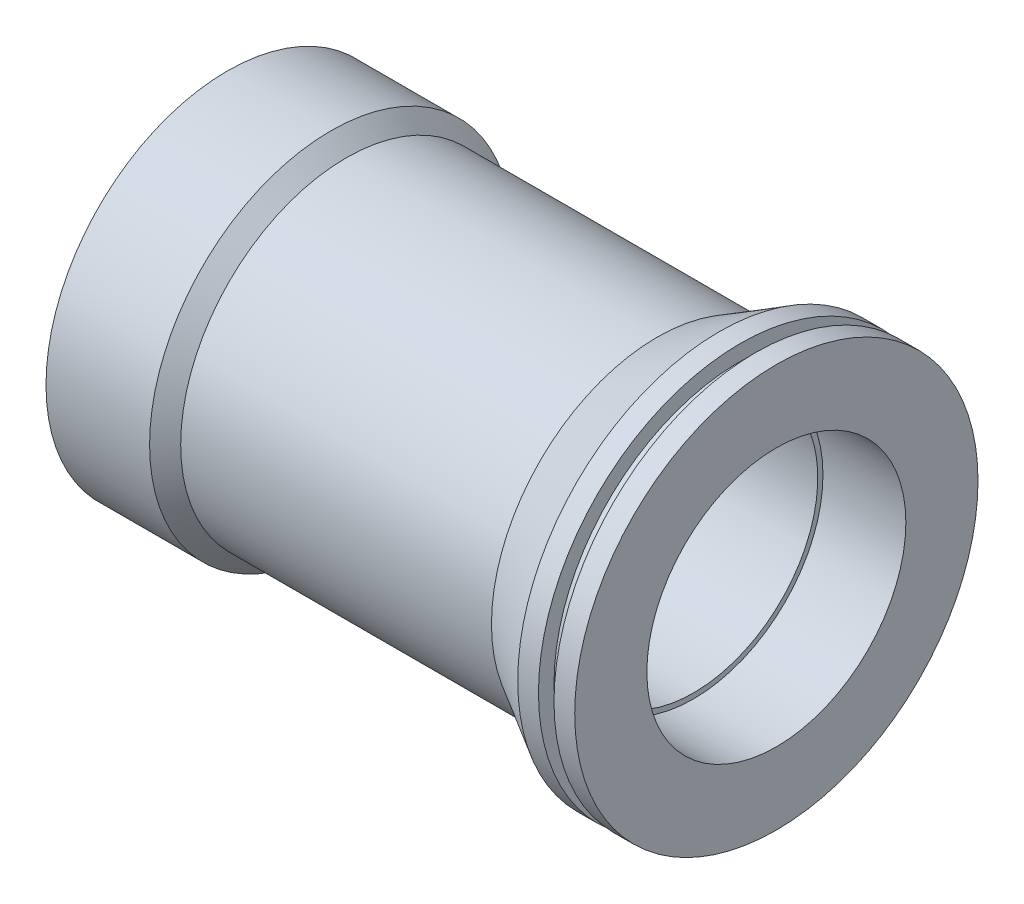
ISO-10303-21;
HEADER;
FILE_DESCRIPTION(('STEP AP214'),'2;1');
FILE_NAME('part.step','',(''),(''),'','','');
FILE_SCHEMA(('AUTOMOTIVE_DESIGN { 1 0 10303 214 1 1 1 1 }'));
ENDSEC;
DATA;
#1=APPLICATION_CONTEXT('core data for automotive mechanical design processes');
#2=APPLICATION_PROTOCOL_DEFINITION('international standard','automotive_design',2000,#1);
#3=PRODUCT_CONTEXT('',#1,'mechanical');
#4=PRODUCT('Part','Part','',(#3));
#5=PRODUCT_RELATED_PRODUCT_CATEGORY('part','',(#4));
#6=PRODUCT_DEFINITION_FORMATION('','',#4);
#7=PRODUCT_DEFINITION_CONTEXT('part definition',#1,'design');
#8=PRODUCT_DEFINITION('design','',#6,#7);
#9=PRODUCT_DEFINITION_SHAPE('','',#8);
#10=(LENGTH_UNIT() NAMED_UNIT(*) SI_UNIT(.MILLI.,.METRE.));
#11=(NAMED_UNIT(*) PLANE_ANGLE_UNIT() SI_UNIT($,.RADIAN.));
#12=(NAMED_UNIT(*) SI_UNIT($,.STERADIAN.) SOLID_ANGLE_UNIT());
#13=UNCERTAINTY_MEASURE_WITH_UNIT(LENGTH_MEASURE(1.E-05),#10,'distance_accuracy_value','');
#14=(GEOMETRIC_REPRESENTATION_CONTEXT(3) GLOBAL_UNCERTAINTY_ASSIGNED_CONTEXT((#13)) GLOBAL_UNIT_ASSIGNED_CONTEXT((#10,
#11,#12)) REPRESENTATION_CONTEXT('',''));
#15=CARTESIAN_POINT('',(0.,0.,0.));
#16=DIRECTION('',(0.,0.,1.));
#17=DIRECTION('',(1.,0.,0.));
#18=AXIS2_PLACEMENT_3D('',#15,#16,#17);
#19=CARTESIAN_POINT('',(88.4065397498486,25.,0.));
#20=DIRECTION('',(-1.,0.,0.));
#21=DIRECTION('',(0.,0.,1.));
#22=AXIS2_PLACEMENT_3D('',#19,#20,#21);
#23=PLANE('',#22);
#24=CARTESIAN_POINT('',(88.4065397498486,0.,0.));
#25=DIRECTION('',(-1.,0.,0.));
#26=DIRECTION('',(0.,0.,1.));
#27=AXIS2_PLACEMENT_3D('',#24,#25,#26);
#28=CIRCLE('',#27,38.9282032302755);
#29=CARTESIAN_POINT('',(88.4065397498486,0.,38.9282032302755));
#30=VERTEX_POINT('',#29);
#31=EDGE_CURVE('E10',#30,#30,#28,.T.);
#32=ORIENTED_EDGE('',*,*,#31,.F.);
#33=EDGE_LOOP('',(#32));
#34=FACE_BOUND('',#33,.T.);
#35=CARTESIAN_POINT('',(88.4065397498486,0.,0.));
#36=DIRECTION('',(-1.,0.,0.));
#37=DIRECTION('',(0.,0.,1.));
#38=AXIS2_PLACEMENT_3D('',#35,#36,#37);
#39=CIRCLE('',#38,25.);
#40=CARTESIAN_POINT('',(88.4065397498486,0.,25.));
#41=VERTEX_POINT('',#40);
#42=EDGE_CURVE('E95',#41,#41,#39,.T.);
#43=ORIENTED_EDGE('',*,*,#42,.T.);
#44=EDGE_LOOP('',(#43));
#45=FACE_BOUND('',#44,.T.);
#46=ADVANCED_FACE('F31',(#34,#45),#23,.F.);
#47=CARTESIAN_POINT('',(-89.2079058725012,0.,0.));
#48=DIRECTION('',(-1.,0.,0.));
#49=DIRECTION('',(0.,0.,1.));
#50=AXIS2_PLACEMENT_3D('',#47,#48,#49);
#51=CYLINDRICAL_SURFACE('',#50,38.9282032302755);
#52=CARTESIAN_POINT('',(84.4065397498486,0.,0.));
#53=DIRECTION('',(-1.,0.,0.));
#54=DIRECTION('',(0.,0.,1.));
#55=AXIS2_PLACEMENT_3D('',#52,#53,#54);
#56=CIRCLE('',#55,38.9282032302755);
#57=CARTESIAN_POINT('',(84.4065397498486,0.,38.9282032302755));
#58=VERTEX_POINT('',#57);
#59=EDGE_CURVE('E37',#58,#58,#56,.T.);
#60=ORIENTED_EDGE('',*,*,#59,.F.);
#61=EDGE_LOOP('',(#60));
#62=FACE_BOUND('',#61,.T.);
#63=ORIENTED_EDGE('',*,*,#31,.T.);
#64=EDGE_LOOP('',(#63));
#65=FACE_BOUND('',#64,.T.);
#66=ADVANCED_FACE('F204',(#62,#65),#51,.T.);
#67=CARTESIAN_POINT('',(84.4065397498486,38.9282032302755,0.));
#68=DIRECTION('',(1.,0.,0.));
#69=DIRECTION('',(0.,0.,-1.));
#70=AXIS2_PLACEMENT_3D('',#67,#68,#69);
#71=PLANE('',#70);
#72=CARTESIAN_POINT('',(84.4065397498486,0.,0.));
#73=DIRECTION('',(-1.,0.,0.));
#74=DIRECTION('',(0.,0.,1.));
#75=AXIS2_PLACEMENT_3D('',#72,#73,#74);
#76=CIRCLE('',#75,35.9282032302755);
#77=CARTESIAN_POINT('',(84.4065397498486,0.,35.9282032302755));
#78=VERTEX_POINT('',#77);
#79=EDGE_CURVE('E41',#78,#78,#76,.T.);
#80=ORIENTED_EDGE('',*,*,#79,.F.);
#81=EDGE_LOOP('',(#80));
#82=FACE_BOUND('',#81,.T.);
#83=ORIENTED_EDGE('',*,*,#59,.T.);
#84=EDGE_LOOP('',(#83));
#85=FACE_BOUND('',#84,.T.);
#86=ADVANCED_FACE('F199',(#82,#85),#71,.F.);
#87=CARTESIAN_POINT('',(-89.2079058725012,0.,0.));
#88=DIRECTION('',(-1.,0.,0.));
#89=DIRECTION('',(0.,0.,1.));
#90=AXIS2_PLACEMENT_3D('',#87,#88,#89);
#91=CYLINDRICAL_SURFACE('',#90,35.9282032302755);
#92=CARTESIAN_POINT('',(81.4065397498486,0.,0.));
#93=DIRECTION('',(-1.,0.,0.));
#94=DIRECTION('',(0.,0.,1.));
#95=AXIS2_PLACEMENT_3D('',#92,#93,#94);
#96=CIRCLE('',#95,35.9282032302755);
#97=CARTESIAN_POINT('',(81.4065397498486,0.,35.9282032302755));
#98=VERTEX_POINT('',#97);
#99=EDGE_CURVE('E45',#98,#98,#96,.T.);
#100=ORIENTED_EDGE('',*,*,#99,.F.);
#101=EDGE_LOOP('',(#100));
#102=FACE_BOUND('',#101,.T.);
#103=ORIENTED_EDGE('',*,*,#79,.T.);
#104=EDGE_LOOP('',(#103));
#105=FACE_BOUND('',#104,.T.);
#106=ADVANCED_FACE('F193',(#102,#105),#91,.T.);
#107=CARTESIAN_POINT('',(81.4065397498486,35.9282032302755,0.));
#108=DIRECTION('',(-1.,0.,0.));
#109=DIRECTION('',(0.,0.,1.));
#110=AXIS2_PLACEMENT_3D('',#107,#108,#109);
#111=PLANE('',#110);
#112=CARTESIAN_POINT('',(81.4065397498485,0.,0.));
#113=DIRECTION('',(-1.,0.,0.));
#114=DIRECTION('',(0.,0.,1.));
#115=AXIS2_PLACEMENT_3D('',#112,#113,#114);
#116=CIRCLE('',#115,38.9282032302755);
#117=CARTESIAN_POINT('',(81.4065397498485,0.,38.9282032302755));
#118=VERTEX_POINT('',#117);
#119=EDGE_CURVE('E50',#118,#118,#116,.T.);
#120=ORIENTED_EDGE('',*,*,#119,.F.);
#121=EDGE_LOOP('',(#120));
#122=FACE_BOUND('',#121,.T.);
#123=ORIENTED_EDGE('',*,*,#99,.T.);
#124=EDGE_LOOP('',(#123));
#125=FACE_BOUND('',#124,.T.);
#126=ADVANCED_FACE('F187',(#122,#125),#111,.F.);
#127=CARTESIAN_POINT('',(-89.2079058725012,0.,0.));
#128=DIRECTION('',(-1.,0.,0.));
#129=DIRECTION('',(0.,0.,1.));
#130=AXIS2_PLACEMENT_3D('',#127,#128,#129);
#131=CYLINDRICAL_SURFACE('',#130,38.9282032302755);
#132=CARTESIAN_POINT('',(77.4065397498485,0.,0.));
#133=DIRECTION('',(-1.,0.,0.));
#134=DIRECTION('',(0.,0.,1.));
#135=AXIS2_PLACEMENT_3D('',#132,#133,#134);
#136=CIRCLE('',#135,38.9282032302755);
#137=CARTESIAN_POINT('',(77.4065397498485,0.,38.9282032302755));
#138=VERTEX_POINT('',#137);
#139=EDGE_CURVE('E53',#138,#138,#136,.T.);
#140=ORIENTED_EDGE('',*,*,#139,.F.);
#141=EDGE_LOOP('',(#140));
#142=FACE_BOUND('',#141,.T.);
#143=ORIENTED_EDGE('',*,*,#119,.T.);
#144=EDGE_LOOP('',(#143));
#145=FACE_BOUND('',#144,.T.);
#146=ADVANCED_FACE('F181',(#142,#145),#131,.T.);
#147=CARTESIAN_POINT('',(77.4065397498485,0.,0.));
#148=DIRECTION('',(1.,0.,0.));
#149=DIRECTION('',(0.,0.,-1.));
#150=AXIS2_PLACEMENT_3D('',#147,#148,#149);
#151=CONICAL_SURFACE('',#150,38.9282032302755,0.5235987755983);
#152=CARTESIAN_POINT('',(65.4065397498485,0.,0.));
#153=DIRECTION('',(-1.,0.,0.));
#154=DIRECTION('',(0.,0.,1.));
#155=AXIS2_PLACEMENT_3D('',#152,#153,#154);
#156=CIRCLE('',#155,32.);
#157=CARTESIAN_POINT('',(65.4065397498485,0.,32.));
#158=VERTEX_POINT('',#157);
#159=EDGE_CURVE('E56',#158,#158,#156,.T.);
#160=ORIENTED_EDGE('',*,*,#159,.F.);
#161=EDGE_LOOP('',(#160));
#162=FACE_BOUND('',#161,.T.);
#163=ORIENTED_EDGE('',*,*,#139,.T.);
#164=EDGE_LOOP('',(#163));
#165=FACE_BOUND('',#164,.T.);
#166=ADVANCED_FACE('F175',(#162,#165),#151,.T.);
#167=CARTESIAN_POINT('',(-89.2079058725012,0.,0.));
#168=DIRECTION('',(-1.,0.,0.));
#169=DIRECTION('',(0.,0.,1.));
#170=AXIS2_PLACEMENT_3D('',#167,#168,#169);
#171=CYLINDRICAL_SURFACE('',#170,32.);
#172=CARTESIAN_POINT('',(5.40653974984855,0.,0.));
#173=DIRECTION('',(-1.,0.,0.));
#174=DIRECTION('',(0.,0.,1.));
#175=AXIS2_PLACEMENT_3D('',#172,#173,#174);
#176=CIRCLE('',#175,32.);
#177=CARTESIAN_POINT('',(5.40653974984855,0.,32.));
#178=VERTEX_POINT('',#177);
#179=EDGE_CURVE('E59',#178,#178,#176,.T.);
#180=ORIENTED_EDGE('',*,*,#179,.F.);
#181=EDGE_LOOP('',(#180));
#182=FACE_BOUND('',#181,.T.);
#183=ORIENTED_EDGE('',*,*,#159,.T.);
#184=EDGE_LOOP('',(#183));
#185=FACE_BOUND('',#184,.T.);
#186=ADVANCED_FACE('F169',(#182,#185),#171,.T.);
#187=CARTESIAN_POINT('',(5.40653974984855,0.,0.));
#188=DIRECTION('',(-1.,0.,0.));
#189=DIRECTION('',(0.,0.,1.));
#190=AXIS2_PLACEMENT_3D('',#187,#188,#189);
#191=CONICAL_SURFACE('',#190,32.,0.785398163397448);
#192=CARTESIAN_POINT('',(2.40653974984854,0.,0.));
#193=DIRECTION('',(-1.,0.,0.));
#194=DIRECTION('',(0.,0.,1.));
#195=AXIS2_PLACEMENT_3D('',#192,#193,#194);
#196=CIRCLE('',#195,35.);
#197=CARTESIAN_POINT('',(2.40653974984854,0.,35.));
#198=VERTEX_POINT('',#197);
#199=EDGE_CURVE('E62',#198,#198,#196,.T.);
#200=ORIENTED_EDGE('',*,*,#199,.F.);
#201=EDGE_LOOP('',(#200));
#202=FACE_BOUND('',#201,.T.);
#203=ORIENTED_EDGE('',*,*,#179,.T.);
#204=EDGE_LOOP('',(#203));
#205=FACE_BOUND('',#204,.T.);
#206=ADVANCED_FACE('F163',(#202,#205),#191,.T.);
#207=CARTESIAN_POINT('',(-89.2079058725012,0.,0.));
#208=DIRECTION('',(-1.,0.,0.));
#209=DIRECTION('',(0.,0.,1.));
#210=AXIS2_PLACEMENT_3D('',#207,#208,#209);
#211=CYLINDRICAL_SURFACE('',#210,35.);
#212=CARTESIAN_POINT('',(-17.5934602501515,0.,0.));
#213=DIRECTION('',(-1.,0.,0.));
#214=DIRECTION('',(0.,0.,1.));
#215=AXIS2_PLACEMENT_3D('',#212,#213,#214);
#216=CIRCLE('',#215,35.);
#217=CARTESIAN_POINT('',(-17.5934602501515,0.,35.));
#218=VERTEX_POINT('',#217);
#219=EDGE_CURVE('E65',#218,#218,#216,.T.);
#220=ORIENTED_EDGE('',*,*,#219,.F.);
#221=EDGE_LOOP('',(#220));
#222=FACE_BOUND('',#221,.T.);
#223=ORIENTED_EDGE('',*,*,#199,.T.);
#224=EDGE_LOOP('',(#223));
#225=FACE_BOUND('',#224,.T.);
#226=ADVANCED_FACE('F157',(#222,#225),#211,.T.);
#227=CARTESIAN_POINT('',(-17.5934602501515,35.,0.));
#228=DIRECTION('',(1.,0.,0.));
#229=DIRECTION('',(0.,0.,-1.));
#230=AXIS2_PLACEMENT_3D('',#227,#228,#229);
#231=PLANE('',#230);
#232=CARTESIAN_POINT('',(-17.5934602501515,0.,0.));
#233=DIRECTION('',(-1.,0.,0.));
#234=DIRECTION('',(0.,0.,1.));
#235=AXIS2_PLACEMENT_3D('',#232,#233,#234);
#236=CIRCLE('',#235,30.);
#237=CARTESIAN_POINT('',(-17.5934602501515,0.,30.));
#238=VERTEX_POINT('',#237);
#239=EDGE_CURVE('E68',#238,#238,#236,.T.);
#240=ORIENTED_EDGE('',*,*,#239,.F.);
#241=EDGE_LOOP('',(#240));
#242=FACE_BOUND('',#241,.T.);
#243=ORIENTED_EDGE('',*,*,#219,.T.);
#244=EDGE_LOOP('',(#243));
#245=FACE_BOUND('',#244,.T.);
#246=ADVANCED_FACE('F151',(#242,#245),#231,.F.);
#247=CARTESIAN_POINT('',(-89.2079058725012,0.,0.));
#248=DIRECTION('',(-1.,0.,0.));
#249=DIRECTION('',(0.,0.,1.));
#250=AXIS2_PLACEMENT_3D('',#247,#248,#249);
#251=CYLINDRICAL_SURFACE('',#250,30.);
#252=CARTESIAN_POINT('',(-2.59346025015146,0.,0.));
#253=DIRECTION('',(-1.,0.,0.));
#254=DIRECTION('',(0.,0.,1.));
#255=AXIS2_PLACEMENT_3D('',#252,#253,#254);
#256=CIRCLE('',#255,30.);
#257=CARTESIAN_POINT('',(-2.59346025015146,0.,30.));
#258=VERTEX_POINT('',#257);
#259=EDGE_CURVE('E71',#258,#258,#256,.T.);
#260=ORIENTED_EDGE('',*,*,#259,.F.);
#261=EDGE_LOOP('',(#260));
#262=FACE_BOUND('',#261,.T.);
#263=ORIENTED_EDGE('',*,*,#239,.T.);
#264=EDGE_LOOP('',(#263));
#265=FACE_BOUND('',#264,.T.);
#266=ADVANCED_FACE('F145',(#262,#265),#251,.F.);
#267=CARTESIAN_POINT('',(-2.59346025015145,30.,0.));
#268=DIRECTION('',(1.,0.,0.));
#269=DIRECTION('',(0.,0.,-1.));
#270=AXIS2_PLACEMENT_3D('',#267,#268,#269);
#271=PLANE('',#270);
#272=CARTESIAN_POINT('',(-2.59346025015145,0.,0.));
#273=DIRECTION('',(-1.,0.,0.));
#274=DIRECTION('',(0.,0.,1.));
#275=AXIS2_PLACEMENT_3D('',#272,#273,#274);
#276=CIRCLE('',#275,22.);
#277=CARTESIAN_POINT('',(-2.59346025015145,0.,22.));
#278=VERTEX_POINT('',#277);
#279=EDGE_CURVE('E74',#278,#278,#276,.T.);
#280=ORIENTED_EDGE('',*,*,#279,.F.);
#281=EDGE_LOOP('',(#280));
#282=FACE_BOUND('',#281,.T.);
#283=ORIENTED_EDGE('',*,*,#259,.T.);
#284=EDGE_LOOP('',(#283));
#285=FACE_BOUND('',#284,.T.);
#286=ADVANCED_FACE('F139',(#282,#285),#271,.F.);
#287=CARTESIAN_POINT('',(-89.2079058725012,0.,0.));
#288=DIRECTION('',(-1.,0.,0.));
#289=DIRECTION('',(0.,0.,1.));
#290=AXIS2_PLACEMENT_3D('',#287,#288,#289);
#291=CYLINDRICAL_SURFACE('',#290,22.);
#292=CARTESIAN_POINT('',(7.40653974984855,0.,0.));
#293=DIRECTION('',(-1.,0.,0.));
#294=DIRECTION('',(0.,0.,1.));
#295=AXIS2_PLACEMENT_3D('',#292,#293,#294);
#296=CIRCLE('',#295,22.);
#297=CARTESIAN_POINT('',(7.40653974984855,0.,22.));
#298=VERTEX_POINT('',#297);
#299=EDGE_CURVE('E77',#298,#298,#296,.T.);
#300=ORIENTED_EDGE('',*,*,#299,.F.);
#301=EDGE_LOOP('',(#300));
#302=FACE_BOUND('',#301,.T.);
#303=ORIENTED_EDGE('',*,*,#279,.T.);
#304=EDGE_LOOP('',(#303));
#305=FACE_BOUND('',#304,.T.);
#306=ADVANCED_FACE('F133',(#302,#305),#291,.F.);
#307=CARTESIAN_POINT('',(7.40653974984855,22.,0.));
#308=DIRECTION('',(-1.,0.,0.));
#309=DIRECTION('',(0.,0.,1.));
#310=AXIS2_PLACEMENT_3D('',#307,#308,#309);
#311=PLANE('',#310);
#312=CARTESIAN_POINT('',(7.40653974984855,0.,0.));
#313=DIRECTION('',(-1.,0.,0.));
#314=DIRECTION('',(0.,0.,1.));
#315=AXIS2_PLACEMENT_3D('',#312,#313,#314);
#316=CIRCLE('',#315,23.);
#317=CARTESIAN_POINT('',(7.40653974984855,0.,23.));
#318=VERTEX_POINT('',#317);
#319=EDGE_CURVE('E80',#318,#318,#316,.T.);
#320=ORIENTED_EDGE('',*,*,#319,.F.);
#321=EDGE_LOOP('',(#320));
#322=FACE_BOUND('',#321,.T.);
#323=ORIENTED_EDGE('',*,*,#299,.T.);
#324=EDGE_LOOP('',(#323));
#325=FACE_BOUND('',#324,.T.);
#326=ADVANCED_FACE('F127',(#322,#325),#311,.F.);
#327=CARTESIAN_POINT('',(-89.2079058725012,0.,0.));
#328=DIRECTION('',(-1.,0.,0.));
#329=DIRECTION('',(0.,0.,1.));
#330=AXIS2_PLACEMENT_3D('',#327,#328,#329);
#331=CYLINDRICAL_SURFACE('',#330,23.);
#332=CARTESIAN_POINT('',(27.4065397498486,0.,0.));
#333=DIRECTION('',(-1.,0.,0.));
#334=DIRECTION('',(0.,0.,1.));
#335=AXIS2_PLACEMENT_3D('',#332,#333,#334);
#336=CIRCLE('',#335,23.);
#337=CARTESIAN_POINT('',(27.4065397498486,0.,23.));
#338=VERTEX_POINT('',#337);
#339=EDGE_CURVE('E83',#338,#338,#336,.T.);
#340=ORIENTED_EDGE('',*,*,#339,.F.);
#341=EDGE_LOOP('',(#340));
#342=FACE_BOUND('',#341,.T.);
#343=ORIENTED_EDGE('',*,*,#319,.T.);
#344=EDGE_LOOP('',(#343));
#345=FACE_BOUND('',#344,.T.);
#346=ADVANCED_FACE('F121',(#342,#345),#331,.F.);
#347=CARTESIAN_POINT('',(27.4065397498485,23.,0.));
#348=DIRECTION('',(-1.,0.,0.));
#349=DIRECTION('',(0.,0.,1.));
#350=AXIS2_PLACEMENT_3D('',#347,#348,#349);
#351=PLANE('',#350);
#352=CARTESIAN_POINT('',(27.4065397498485,0.,0.));
#353=DIRECTION('',(-1.,0.,0.));
#354=DIRECTION('',(0.,0.,1.));
#355=AXIS2_PLACEMENT_3D('',#352,#353,#354);
#356=CIRCLE('',#355,24.);
#357=CARTESIAN_POINT('',(27.4065397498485,0.,24.));
#358=VERTEX_POINT('',#357);
#359=EDGE_CURVE('E86',#358,#358,#356,.T.);
#360=ORIENTED_EDGE('',*,*,#359,.F.);
#361=EDGE_LOOP('',(#360));
#362=FACE_BOUND('',#361,.T.);
#363=ORIENTED_EDGE('',*,*,#339,.T.);
#364=EDGE_LOOP('',(#363));
#365=FACE_BOUND('',#364,.T.);
#366=ADVANCED_FACE('F115',(#362,#365),#351,.F.);
#367=CARTESIAN_POINT('',(-89.2079058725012,0.,0.));
#368=DIRECTION('',(-1.,0.,0.));
#369=DIRECTION('',(0.,0.,1.));
#370=AXIS2_PLACEMENT_3D('',#367,#368,#369);
#371=CYLINDRICAL_SURFACE('',#370,24.);
#372=CARTESIAN_POINT('',(72.4065397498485,0.,0.));
#373=DIRECTION('',(-1.,0.,0.));
#374=DIRECTION('',(0.,0.,1.));
#375=AXIS2_PLACEMENT_3D('',#372,#373,#374);
#376=CIRCLE('',#375,24.);
#377=CARTESIAN_POINT('',(72.4065397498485,0.,24.));
#378=VERTEX_POINT('',#377);
#379=EDGE_CURVE('E89',#378,#378,#376,.T.);
#380=ORIENTED_EDGE('',*,*,#379,.F.);
#381=EDGE_LOOP('',(#380));
#382=FACE_BOUND('',#381,.T.);
#383=ORIENTED_EDGE('',*,*,#359,.T.);
#384=EDGE_LOOP('',(#383));
#385=FACE_BOUND('',#384,.T.);
#386=ADVANCED_FACE('F109',(#382,#385),#371,.F.);
#387=CARTESIAN_POINT('',(72.4065397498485,24.,0.));
#388=DIRECTION('',(-1.,0.,0.));
#389=DIRECTION('',(0.,0.,1.));
#390=AXIS2_PLACEMENT_3D('',#387,#388,#389);
#391=PLANE('',#390);
#392=CARTESIAN_POINT('',(72.4065397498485,0.,0.));
#393=DIRECTION('',(-1.,0.,0.));
#394=DIRECTION('',(0.,0.,1.));
#395=AXIS2_PLACEMENT_3D('',#392,#393,#394);
#396=CIRCLE('',#395,25.);
#397=CARTESIAN_POINT('',(72.4065397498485,0.,25.));
#398=VERTEX_POINT('',#397);
#399=EDGE_CURVE('E92',#398,#398,#396,.T.);
#400=ORIENTED_EDGE('',*,*,#399,.F.);
#401=EDGE_LOOP('',(#400));
#402=FACE_BOUND('',#401,.T.);
#403=ORIENTED_EDGE('',*,*,#379,.T.);
#404=EDGE_LOOP('',(#403));
#405=FACE_BOUND('',#404,.T.);
#406=ADVANCED_FACE('F103',(#402,#405),#391,.F.);
#407=CARTESIAN_POINT('',(-89.2079058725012,0.,0.));
#408=DIRECTION('',(-1.,0.,0.));
#409=DIRECTION('',(0.,0.,1.));
#410=AXIS2_PLACEMENT_3D('',#407,#408,#409);
#411=CYLINDRICAL_SURFACE('',#410,25.);
#412=ORIENTED_EDGE('',*,*,#42,.F.);
#413=EDGE_LOOP('',(#412));
#414=FACE_BOUND('',#413,.T.);
#415=ORIENTED_EDGE('',*,*,#399,.T.);
#416=EDGE_LOOP('',(#415));
#417=FACE_BOUND('',#416,.T.);
#418=ADVANCED_FACE('F100',(#414,#417),#411,.F.);
#419=CLOSED_SHELL('',(#46,#66,#86,#106,#126,#146,#166,#186,#206,#226,#246,#266,#286,#306,#326,
#346,#366,#386,#406,#418));
#420=MANIFOLD_SOLID_BREP('B2',#419);
#421=ADVANCED_BREP_SHAPE_REPRESENTATION('',(#18,#420),#14);
#422=SHAPE_DEFINITION_REPRESENTATION(#9,#421);
ENDSEC;
END-ISO-10303-21;
